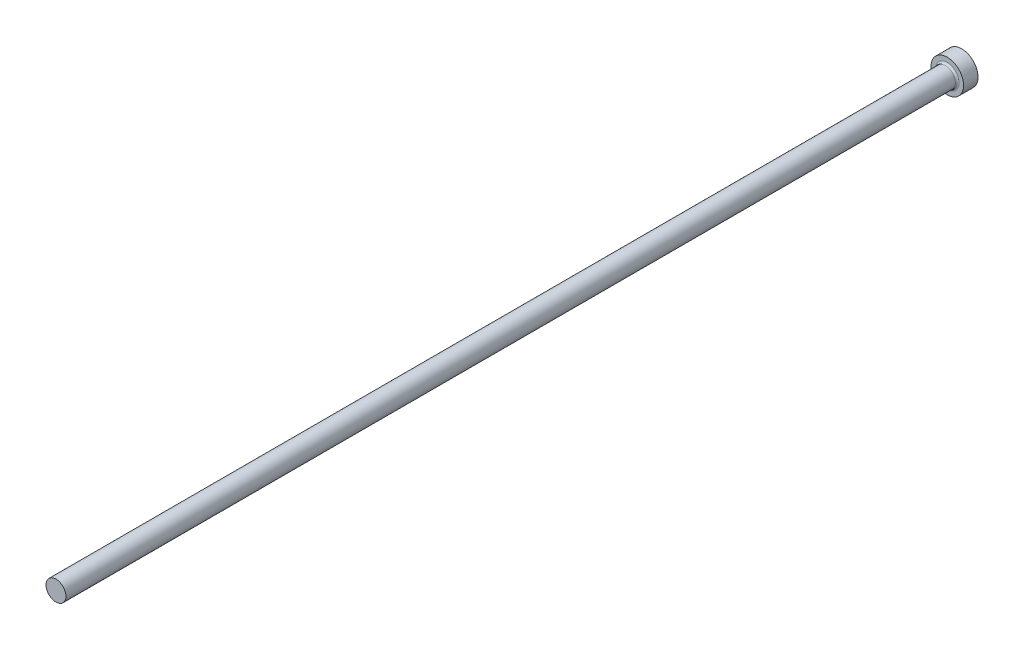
ISO-10303-21;
HEADER;
FILE_DESCRIPTION(('STEP AP214'),'2;1');
FILE_NAME('part.step','',(''),(''),'','','');
FILE_SCHEMA(('AUTOMOTIVE_DESIGN { 1 0 10303 214 1 1 1 1 }'));
ENDSEC;
DATA;
#1=APPLICATION_CONTEXT('core data for automotive mechanical design processes');
#2=APPLICATION_PROTOCOL_DEFINITION('international standard','automotive_design',2000,#1);
#3=PRODUCT_CONTEXT('',#1,'mechanical');
#4=PRODUCT('Part','Part','',(#3));
#5=PRODUCT_RELATED_PRODUCT_CATEGORY('part','',(#4));
#6=PRODUCT_DEFINITION_FORMATION('','',#4);
#7=PRODUCT_DEFINITION_CONTEXT('part definition',#1,'design');
#8=PRODUCT_DEFINITION('design','',#6,#7);
#9=PRODUCT_DEFINITION_SHAPE('','',#8);
#10=(LENGTH_UNIT() NAMED_UNIT(*) SI_UNIT(.MILLI.,.METRE.));
#11=(NAMED_UNIT(*) PLANE_ANGLE_UNIT() SI_UNIT($,.RADIAN.));
#12=(NAMED_UNIT(*) SI_UNIT($,.STERADIAN.) SOLID_ANGLE_UNIT());
#13=UNCERTAINTY_MEASURE_WITH_UNIT(LENGTH_MEASURE(1.E-05),#10,'distance_accuracy_value','');
#14=(GEOMETRIC_REPRESENTATION_CONTEXT(3) GLOBAL_UNCERTAINTY_ASSIGNED_CONTEXT((#13)) GLOBAL_UNIT_ASSIGNED_CONTEXT((#10,
#11,#12)) REPRESENTATION_CONTEXT('',''));
#15=CARTESIAN_POINT('',(0.,0.,0.));
#16=DIRECTION('',(0.,0.,1.));
#17=DIRECTION('',(1.,0.,0.));
#18=AXIS2_PLACEMENT_3D('',#15,#16,#17);
#19=CARTESIAN_POINT('',(4.5,0.,4.));
#20=DIRECTION('',(0.,0.,-1.));
#21=DIRECTION('',(-1.,0.,0.));
#22=AXIS2_PLACEMENT_3D('',#19,#20,#21);
#23=PLANE('',#22);
#24=CARTESIAN_POINT('',(0.,0.,4.));
#25=DIRECTION('',(0.,0.,-1.));
#26=DIRECTION('',(-1.,0.,0.));
#27=AXIS2_PLACEMENT_3D('',#24,#25,#26);
#28=CIRCLE('',#27,3.25000000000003);
#29=CARTESIAN_POINT('',(-3.25000000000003,0.,4.));
#30=VERTEX_POINT('',#29);
#31=EDGE_CURVE('E40',#30,#30,#28,.T.);
#32=ORIENTED_EDGE('',*,*,#31,.T.);
#33=EDGE_LOOP('',(#32));
#34=FACE_BOUND('',#33,.T.);
#35=CARTESIAN_POINT('',(0.,0.,4.));
#36=DIRECTION('',(0.,0.,-1.));
#37=DIRECTION('',(-1.,0.,0.));
#38=AXIS2_PLACEMENT_3D('',#35,#36,#37);
#39=CIRCLE('',#38,4.5);
#40=CARTESIAN_POINT('',(-4.5,0.,4.));
#41=VERTEX_POINT('',#40);
#42=EDGE_CURVE('E44',#41,#41,#39,.T.);
#43=ORIENTED_EDGE('',*,*,#42,.F.);
#44=EDGE_LOOP('',(#43));
#45=FACE_BOUND('',#44,.T.);
#46=ADVANCED_FACE('F33',(#34,#45),#23,.F.);
#47=CARTESIAN_POINT('',(0.,0.,-9.03322817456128));
#48=DIRECTION('',(0.,0.,-1.));
#49=DIRECTION('',(-1.,0.,0.));
#50=AXIS2_PLACEMENT_3D('',#47,#48,#49);
#51=CYLINDRICAL_SURFACE('',#50,4.5);
#52=CARTESIAN_POINT('',(0.,0.,0.));
#53=DIRECTION('',(0.,0.,-1.));
#54=DIRECTION('',(-1.,0.,0.));
#55=AXIS2_PLACEMENT_3D('',#52,#53,#54);
#56=CIRCLE('',#55,4.5);
#57=CARTESIAN_POINT('',(-4.5,0.,0.));
#58=VERTEX_POINT('',#57);
#59=EDGE_CURVE('E48',#58,#58,#56,.T.);
#60=ORIENTED_EDGE('',*,*,#59,.F.);
#61=EDGE_LOOP('',(#60));
#62=FACE_BOUND('',#61,.T.);
#63=ORIENTED_EDGE('',*,*,#42,.T.);
#64=EDGE_LOOP('',(#63));
#65=FACE_BOUND('',#64,.T.);
#66=ADVANCED_FACE('F68',(#62,#65),#51,.T.);
#67=CARTESIAN_POINT('',(0.,0.,0.));
#68=DIRECTION('',(0.,0.,1.));
#69=DIRECTION('',(1.,0.,0.));
#70=AXIS2_PLACEMENT_3D('',#67,#68,#69);
#71=PLANE('',#70);
#72=ORIENTED_EDGE('',*,*,#59,.T.);
#73=EDGE_LOOP('',(#72));
#74=FACE_BOUND('',#73,.T.);
#75=ADVANCED_FACE('F61',(#74),#71,.F.);
#76=CARTESIAN_POINT('',(0.,0.,250.));
#77=DIRECTION('',(0.,0.,-1.));
#78=DIRECTION('',(-1.,0.,0.));
#79=AXIS2_PLACEMENT_3D('',#76,#77,#78);
#80=PLANE('',#79);
#81=CARTESIAN_POINT('',(0.,0.,250.));
#82=DIRECTION('',(0.,0.,-1.));
#83=DIRECTION('',(-1.,0.,0.));
#84=AXIS2_PLACEMENT_3D('',#81,#82,#83);
#85=CIRCLE('',#84,2.75000000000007);
#86=CARTESIAN_POINT('',(-2.75000000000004,0.,250.));
#87=VERTEX_POINT('',#86);
#88=EDGE_CURVE('E53',#87,#87,#85,.T.);
#89=ORIENTED_EDGE('',*,*,#88,.F.);
#90=EDGE_LOOP('',(#89));
#91=FACE_BOUND('',#90,.T.);
#92=ADVANCED_FACE('F59',(#91),#80,.F.);
#93=CARTESIAN_POINT('',(0.,0.,-9.03322817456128));
#94=DIRECTION('',(0.,0.,-1.));
#95=DIRECTION('',(-1.,0.,0.));
#96=AXIS2_PLACEMENT_3D('',#93,#94,#95);
#97=CYLINDRICAL_SURFACE('',#96,2.75000000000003);
#98=CARTESIAN_POINT('',(0.,0.,4.5));
#99=DIRECTION('',(0.,0.,-1.));
#100=DIRECTION('',(-1.,0.,0.));
#101=AXIS2_PLACEMENT_3D('',#98,#99,#100);
#102=CIRCLE('',#101,2.75000000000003);
#103=CARTESIAN_POINT('',(-2.75000000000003,0.,4.5));
#104=VERTEX_POINT('',#103);
#105=EDGE_CURVE('E10',#104,#104,#102,.F.);
#106=ORIENTED_EDGE('',*,*,#105,.T.);
#107=EDGE_LOOP('',(#106));
#108=FACE_BOUND('',#107,.T.);
#109=ORIENTED_EDGE('',*,*,#88,.T.);
#110=EDGE_LOOP('',(#109));
#111=FACE_BOUND('',#110,.T.);
#112=ADVANCED_FACE('F57',(#108,#111),#97,.T.);
#113=CARTESIAN_POINT('',(0.,0.,4.5));
#114=DIRECTION('',(0.,0.,-1.));
#115=DIRECTION('',(-1.,0.,0.));
#116=AXIS2_PLACEMENT_3D('',#113,#114,#115);
#117=TOROIDAL_SURFACE('',#116,3.25000000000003,0.5);
#118=ORIENTED_EDGE('',*,*,#105,.F.);
#119=EDGE_LOOP('',(#118));
#120=FACE_BOUND('',#119,.T.);
#121=ORIENTED_EDGE('',*,*,#31,.F.);
#122=EDGE_LOOP('',(#121));
#123=FACE_BOUND('',#122,.T.);
#124=ADVANCED_FACE('F35',(#120,#123),#117,.F.);
#125=CLOSED_SHELL('',(#46,#66,#75,#92,#112,#124));
#126=MANIFOLD_SOLID_BREP('B2',#125);
#127=ADVANCED_BREP_SHAPE_REPRESENTATION('',(#18,#126),#14);
#128=SHAPE_DEFINITION_REPRESENTATION(#9,#127);
ENDSEC;
END-ISO-10303-21;
